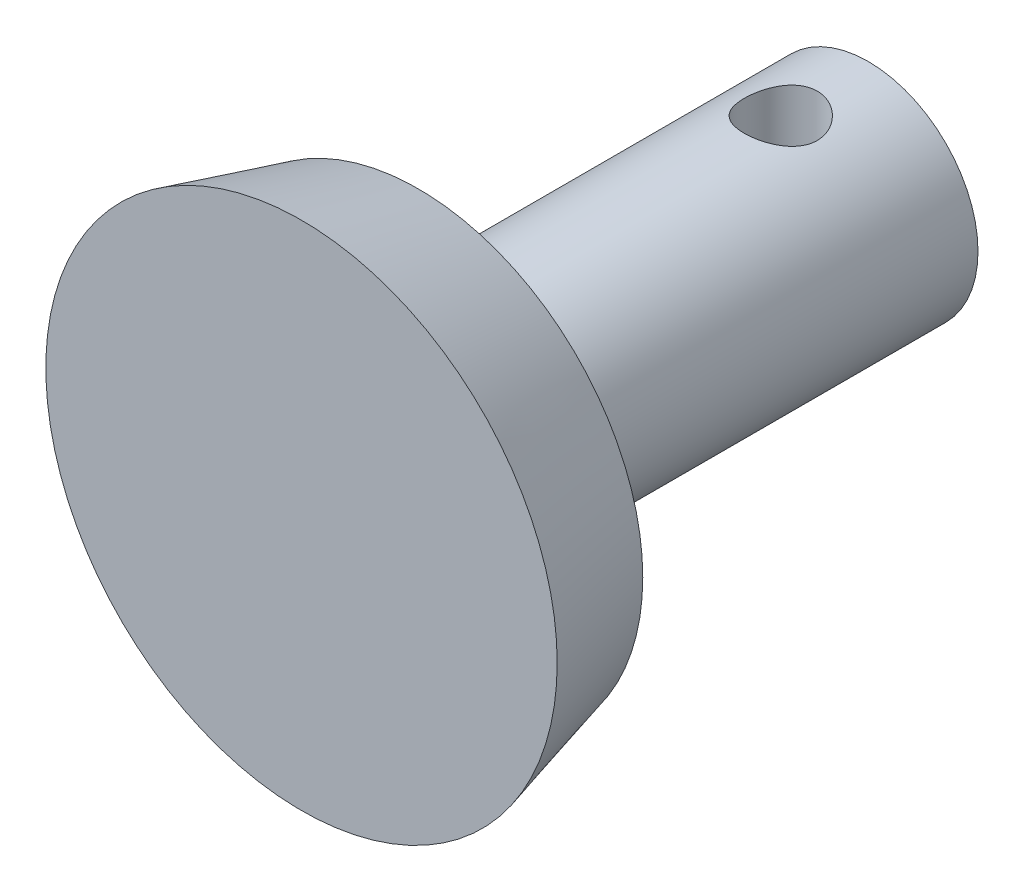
from build123d import *

# Parameters (mm, degrees)
SKETCH1_R           = 11.1125
EXTRUDE1_DEPTH      = 5.08
EXTRUDE1_DRAFT      = -15
SKETCH2_R           = 4.7625
EXTRUDE2_DEPTH      = 19.558
EXTRUDE3_DEPTH      = 30.22338715
EXTRUDE3_DEPTH_BACK = 30.22338715
SKETCH3_R           = 1.5875


with BuildPart() as part:
    # Sketch1 → Extrude1 (with draft: the straight prism first)
    with BuildSketch(Plane.XY):
        Circle(SKETCH1_R)
    extrude(amount=-EXTRUDE1_DEPTH)
    # Extrude1: the draft: its side faces are tilted about the plane it starts from
    extrude1_sides = [part.faces().sort_by_distance(p)[0] for p in [
        (-11.1125, 0, -2.54),
    ]]
    draft(extrude1_sides, Plane.XY, EXTRUDE1_DRAFT)

    # Sketch2 → Extrude2 (add)
    with BuildSketch(Plane(origin=(0, 0, -5.08), x_dir=(-1, 0, 0), z_dir=(0, 0, -1))):
        with Locations(Location((0, 0, 0), (0, 0, 180))):
            Circle(SKETCH2_R)
    extrude(amount=EXTRUDE2_DEPTH)

    # Sketch3 → Extrude3 (cut, two sides: drawn at the far end of the back side and taken through both)
    with BuildSketch(Plane(origin=(0, 0, 0), x_dir=(1, 0, 0), z_dir=(0, 1, 0)).offset(-EXTRUDE3_DEPTH_BACK)):
        with Locations(Location((0, 20.828, 0), (0, 0, 270))):
            Circle(SKETCH3_R)
    extrude(amount=EXTRUDE3_DEPTH + EXTRUDE3_DEPTH_BACK, mode=Mode.SUBTRACT)


solid = part.part
